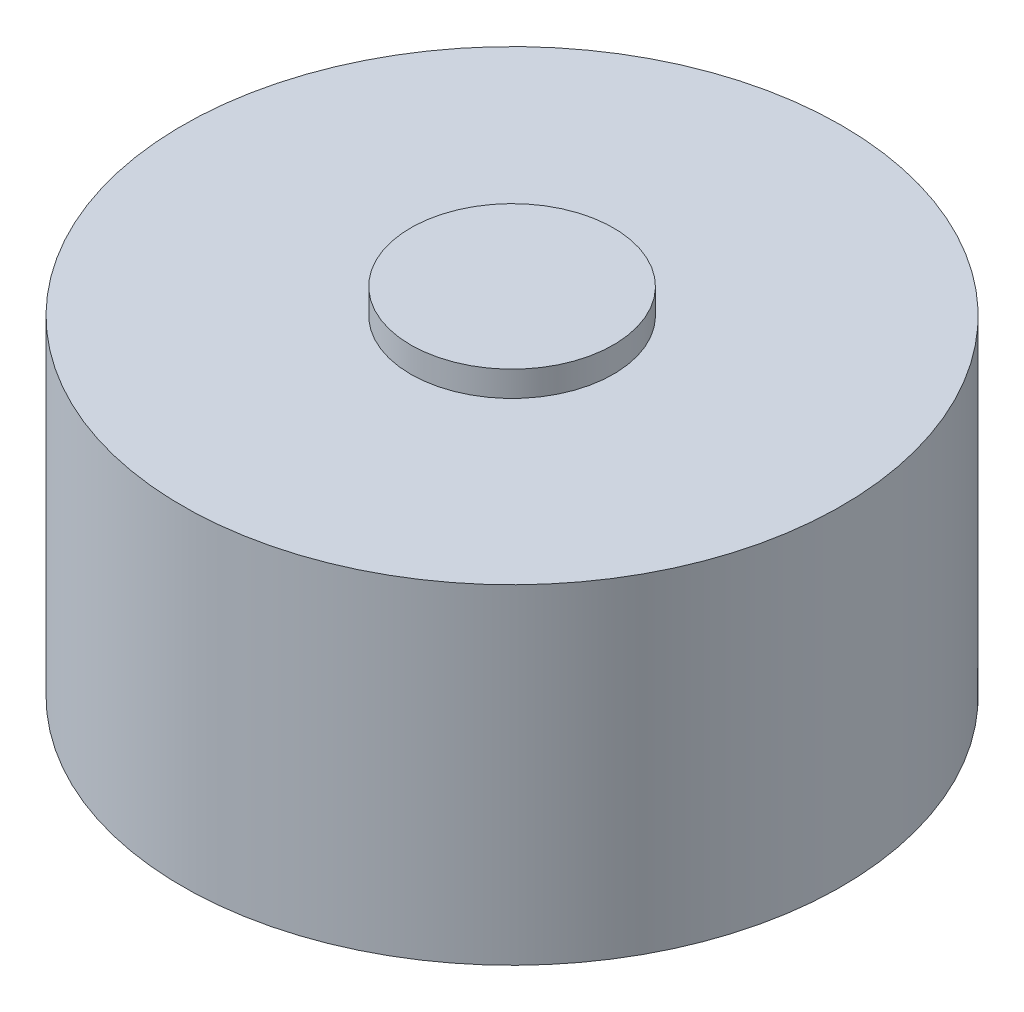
ISO-10303-21;
HEADER;
FILE_DESCRIPTION(('STEP AP214'),'2;1');
FILE_NAME('part.step','',(''),(''),'','','');
FILE_SCHEMA(('AUTOMOTIVE_DESIGN { 1 0 10303 214 1 1 1 1 }'));
ENDSEC;
DATA;
#1=APPLICATION_CONTEXT('core data for automotive mechanical design processes');
#2=APPLICATION_PROTOCOL_DEFINITION('international standard','automotive_design',2000,#1);
#3=PRODUCT_CONTEXT('',#1,'mechanical');
#4=PRODUCT('Part','Part','',(#3));
#5=PRODUCT_RELATED_PRODUCT_CATEGORY('part','',(#4));
#6=PRODUCT_DEFINITION_FORMATION('','',#4);
#7=PRODUCT_DEFINITION_CONTEXT('part definition',#1,'design');
#8=PRODUCT_DEFINITION('design','',#6,#7);
#9=PRODUCT_DEFINITION_SHAPE('','',#8);
#10=(LENGTH_UNIT() NAMED_UNIT(*) SI_UNIT(.MILLI.,.METRE.));
#11=(NAMED_UNIT(*) PLANE_ANGLE_UNIT() SI_UNIT($,.RADIAN.));
#12=(NAMED_UNIT(*) SI_UNIT($,.STERADIAN.) SOLID_ANGLE_UNIT());
#13=UNCERTAINTY_MEASURE_WITH_UNIT(LENGTH_MEASURE(1.E-05),#10,'distance_accuracy_value','');
#14=(GEOMETRIC_REPRESENTATION_CONTEXT(3) GLOBAL_UNCERTAINTY_ASSIGNED_CONTEXT((#13)) GLOBAL_UNIT_ASSIGNED_CONTEXT((#10,
#11,#12)) REPRESENTATION_CONTEXT('',''));
#15=CARTESIAN_POINT('',(0.,0.,0.));
#16=DIRECTION('',(0.,0.,1.));
#17=DIRECTION('',(1.,0.,0.));
#18=AXIS2_PLACEMENT_3D('',#15,#16,#17);
#19=CARTESIAN_POINT('',(0.,6.5,0.));
#20=DIRECTION('',(0.,-1.,0.));
#21=DIRECTION('',(0.,0.,-1.));
#22=AXIS2_PLACEMENT_3D('',#19,#20,#21);
#23=CYLINDRICAL_SURFACE('',#22,6.5);
#24=CARTESIAN_POINT('',(0.,6.5,0.));
#25=DIRECTION('',(0.,1.,0.));
#26=DIRECTION('',(0.,0.,1.));
#27=AXIS2_PLACEMENT_3D('',#24,#25,#26);
#28=CIRCLE('',#27,6.5);
#29=CARTESIAN_POINT('',(0.,6.5,-6.5));
#30=VERTEX_POINT('',#29);
#31=EDGE_CURVE('E10',#30,#30,#28,.T.);
#32=CARTESIAN_POINT('',(0.,0.,0.));
#33=DIRECTION('',(0.,1.,0.));
#34=DIRECTION('',(0.,0.,1.));
#35=AXIS2_PLACEMENT_3D('',#32,#33,#34);
#36=CIRCLE('',#35,6.5);
#37=CARTESIAN_POINT('',(0.,0.,-6.5));
#38=VERTEX_POINT('',#37);
#39=EDGE_CURVE('E34',#38,#38,#36,.T.);
#40=CARTESIAN_POINT('',(0.,6.5,-6.5));
#41=CARTESIAN_POINT('',(0.,6.43229166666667,-6.5));
#42=CARTESIAN_POINT('',(0.,6.36458333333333,-6.5));
#43=CARTESIAN_POINT('',(0.,6.22916666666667,-6.5));
#44=CARTESIAN_POINT('',(0.,6.16145833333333,-6.5));
#45=CARTESIAN_POINT('',(0.,6.02604166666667,-6.5));
#46=CARTESIAN_POINT('',(0.,5.95833333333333,-6.5));
#47=CARTESIAN_POINT('',(0.,5.82291666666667,-6.5));
#48=CARTESIAN_POINT('',(0.,5.75520833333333,-6.5));
#49=CARTESIAN_POINT('',(0.,5.61979166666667,-6.5));
#50=CARTESIAN_POINT('',(0.,5.55208333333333,-6.5));
#51=CARTESIAN_POINT('',(0.,5.41666666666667,-6.5));
#52=CARTESIAN_POINT('',(0.,5.34895833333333,-6.5));
#53=CARTESIAN_POINT('',(0.,5.21354166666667,-6.5));
#54=CARTESIAN_POINT('',(0.,5.14583333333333,-6.5));
#55=CARTESIAN_POINT('',(0.,5.01041666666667,-6.5));
#56=CARTESIAN_POINT('',(0.,4.94270833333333,-6.5));
#57=CARTESIAN_POINT('',(0.,4.80729166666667,-6.5));
#58=CARTESIAN_POINT('',(0.,4.73958333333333,-6.5));
#59=CARTESIAN_POINT('',(0.,4.60416666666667,-6.5));
#60=CARTESIAN_POINT('',(0.,4.53645833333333,-6.5));
#61=CARTESIAN_POINT('',(0.,4.40104166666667,-6.5));
#62=CARTESIAN_POINT('',(0.,4.33333333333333,-6.5));
#63=CARTESIAN_POINT('',(0.,4.19791666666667,-6.5));
#64=CARTESIAN_POINT('',(0.,4.13020833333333,-6.5));
#65=CARTESIAN_POINT('',(0.,3.99479166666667,-6.5));
#66=CARTESIAN_POINT('',(0.,3.92708333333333,-6.5));
#67=CARTESIAN_POINT('',(0.,3.79166666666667,-6.5));
#68=CARTESIAN_POINT('',(0.,3.72395833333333,-6.5));
#69=CARTESIAN_POINT('',(0.,3.58854166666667,-6.5));
#70=CARTESIAN_POINT('',(0.,3.52083333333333,-6.5));
#71=CARTESIAN_POINT('',(0.,3.38541666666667,-6.5));
#72=CARTESIAN_POINT('',(0.,3.31770833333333,-6.5));
#73=CARTESIAN_POINT('',(0.,3.18229166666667,-6.5));
#74=CARTESIAN_POINT('',(0.,3.11458333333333,-6.5));
#75=CARTESIAN_POINT('',(0.,2.97916666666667,-6.5));
#76=CARTESIAN_POINT('',(0.,2.91145833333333,-6.5));
#77=CARTESIAN_POINT('',(0.,2.77604166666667,-6.5));
#78=CARTESIAN_POINT('',(0.,2.70833333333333,-6.5));
#79=CARTESIAN_POINT('',(0.,2.57291666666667,-6.5));
#80=CARTESIAN_POINT('',(0.,2.50520833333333,-6.5));
#81=CARTESIAN_POINT('',(0.,2.36979166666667,-6.5));
#82=CARTESIAN_POINT('',(0.,2.30208333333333,-6.5));
#83=CARTESIAN_POINT('',(0.,2.16666666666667,-6.5));
#84=CARTESIAN_POINT('',(0.,2.09895833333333,-6.5));
#85=CARTESIAN_POINT('',(0.,1.96354166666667,-6.5));
#86=CARTESIAN_POINT('',(0.,1.89583333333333,-6.5));
#87=CARTESIAN_POINT('',(0.,1.76041666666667,-6.5));
#88=CARTESIAN_POINT('',(0.,1.69270833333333,-6.5));
#89=CARTESIAN_POINT('',(0.,1.55729166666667,-6.5));
#90=CARTESIAN_POINT('',(0.,1.48958333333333,-6.5));
#91=CARTESIAN_POINT('',(0.,1.35416666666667,-6.5));
#92=CARTESIAN_POINT('',(0.,1.28645833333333,-6.5));
#93=CARTESIAN_POINT('',(0.,1.15104166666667,-6.5));
#94=CARTESIAN_POINT('',(0.,1.08333333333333,-6.5));
#95=CARTESIAN_POINT('',(0.,0.947916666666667,-6.5));
#96=CARTESIAN_POINT('',(0.,0.880208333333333,-6.5));
#97=CARTESIAN_POINT('',(0.,0.744791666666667,-6.5));
#98=CARTESIAN_POINT('',(0.,0.677083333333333,-6.5));
#99=CARTESIAN_POINT('',(0.,0.541666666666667,-6.5));
#100=CARTESIAN_POINT('',(0.,0.473958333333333,-6.5));
#101=CARTESIAN_POINT('',(0.,0.338541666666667,-6.5));
#102=CARTESIAN_POINT('',(0.,0.270833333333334,-6.5));
#103=CARTESIAN_POINT('',(0.,0.135416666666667,-6.5));
#104=CARTESIAN_POINT('',(0.,0.0677083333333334,-6.5));
#105=CARTESIAN_POINT('',(0.,0.,-6.5));
#106=B_SPLINE_CURVE_WITH_KNOTS('',3,(#40,#41,#42,#43,#44,#45,#46,#47,#48,#49,#50,#51,#52,#53,
#54,#55,#56,#57,#58,#59,#60,#61,#62,#63,#64,#65,#66,#67,#68,#69,#70,#71,#72,#73,#74,#75,#76,#77,
#78,#79,#80,#81,#82,#83,#84,#85,#86,#87,#88,#89,#90,#91,#92,#93,#94,#95,#96,#97,#98,#99,#100,
#101,#102,#103,#104,#105),.UNSPECIFIED.,.F.,.F.,(4,2,2,2,2,2,2,2,2,2,2,2,2,2,2,2,2,2,2,2,2,2,2,
2,2,2,2,2,2,2,2,2,4),(0.,0.203124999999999,0.40625,0.609375,0.812499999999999,1.015625,1.21875,
1.421875,1.625,1.828125,2.03125,2.234375,2.4375,2.640625,2.84375,3.046875,3.25,3.453125,3.65625,
3.859375,4.0625,4.265625,4.46875,4.671875,4.875,5.078125,5.28125,5.484375,5.6875,5.890625,
6.09375,6.296875,6.5),.UNSPECIFIED.);
#107=EDGE_CURVE('BSEAM31',#30,#38,#106,.T.);
#108=ORIENTED_EDGE('',*,*,#31,.F.);
#109=ORIENTED_EDGE('',*,*,#39,.T.);
#110=ORIENTED_EDGE('',*,*,#107,.T.);
#111=ORIENTED_EDGE('',*,*,#107,.F.);
#112=EDGE_LOOP('',(#108,#110,#109,#111));
#113=FACE_BOUND('',#112,.T.);
#114=ADVANCED_FACE('F31',(#113),#23,.T.);
#115=CARTESIAN_POINT('',(0.,6.5,0.));
#116=DIRECTION('',(0.,1.,0.));
#117=DIRECTION('',(0.,0.,1.));
#118=AXIS2_PLACEMENT_3D('',#115,#116,#117);
#119=PLANE('',#118);
#120=CARTESIAN_POINT('',(0.,6.5,0.));
#121=DIRECTION('',(0.,1.,0.));
#122=DIRECTION('',(0.,0.,1.));
#123=AXIS2_PLACEMENT_3D('',#120,#121,#122);
#124=CIRCLE('',#123,2.);
#125=CARTESIAN_POINT('',(0.,6.5,2.));
#126=VERTEX_POINT('',#125);
#127=EDGE_CURVE('E43',#126,#126,#124,.T.);
#128=ORIENTED_EDGE('',*,*,#127,.F.);
#129=EDGE_LOOP('',(#128));
#130=FACE_BOUND('',#129,.T.);
#131=ORIENTED_EDGE('',*,*,#31,.T.);
#132=EDGE_LOOP('',(#131));
#133=FACE_BOUND('',#132,.T.);
#134=ADVANCED_FACE('F58',(#130,#133),#119,.T.);
#135=CARTESIAN_POINT('',(0.,0.,0.));
#136=DIRECTION('',(0.,1.,0.));
#137=DIRECTION('',(0.,0.,1.));
#138=AXIS2_PLACEMENT_3D('',#135,#136,#137);
#139=PLANE('',#138);
#140=ORIENTED_EDGE('',*,*,#39,.F.);
#141=EDGE_LOOP('',(#140));
#142=FACE_BOUND('',#141,.T.);
#143=ADVANCED_FACE('F54',(#142),#139,.F.);
#144=CARTESIAN_POINT('',(0.,7.,0.));
#145=DIRECTION('',(0.,-1.,0.));
#146=DIRECTION('',(0.,0.,-1.));
#147=AXIS2_PLACEMENT_3D('',#144,#145,#146);
#148=CYLINDRICAL_SURFACE('',#147,2.);
#149=CARTESIAN_POINT('',(0.,7.,0.));
#150=DIRECTION('',(0.,1.,0.));
#151=DIRECTION('',(0.,0.,1.));
#152=AXIS2_PLACEMENT_3D('',#149,#150,#151);
#153=CIRCLE('',#152,2.);
#154=CARTESIAN_POINT('',(0.,7.,2.));
#155=VERTEX_POINT('',#154);
#156=EDGE_CURVE('E41',#155,#155,#153,.T.);
#157=ORIENTED_EDGE('',*,*,#156,.F.);
#158=EDGE_LOOP('',(#157));
#159=FACE_BOUND('',#158,.T.);
#160=ORIENTED_EDGE('',*,*,#127,.T.);
#161=EDGE_LOOP('',(#160));
#162=FACE_BOUND('',#161,.T.);
#163=ADVANCED_FACE('F51',(#159,#162),#148,.T.);
#164=CARTESIAN_POINT('',(0.,7.,0.));
#165=DIRECTION('',(0.,1.,0.));
#166=DIRECTION('',(0.,0.,1.));
#167=AXIS2_PLACEMENT_3D('',#164,#165,#166);
#168=PLANE('',#167);
#169=ORIENTED_EDGE('',*,*,#156,.T.);
#170=EDGE_LOOP('',(#169));
#171=FACE_BOUND('',#170,.T.);
#172=ADVANCED_FACE('F49',(#171),#168,.T.);
#173=CLOSED_SHELL('',(#114,#134,#143,#163,#172));
#174=MANIFOLD_SOLID_BREP('B2',#173);
#175=ADVANCED_BREP_SHAPE_REPRESENTATION('',(#18,#174),#14);
#176=SHAPE_DEFINITION_REPRESENTATION(#9,#175);
ENDSEC;
END-ISO-10303-21;
